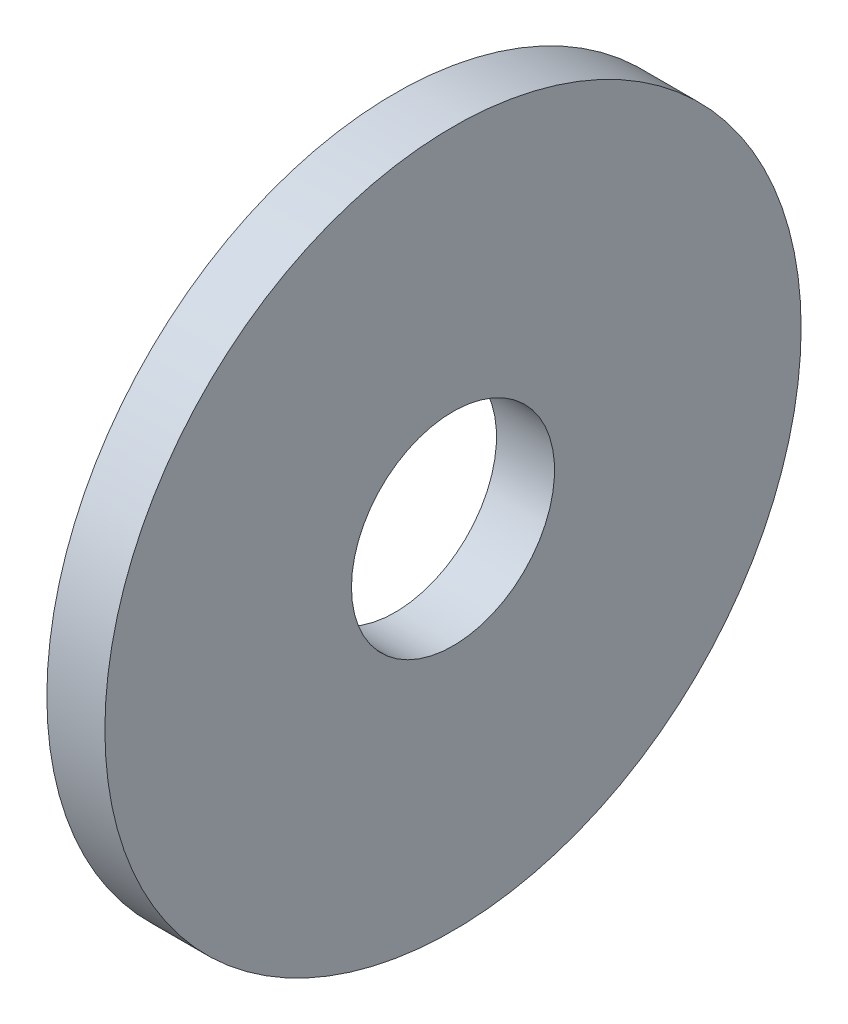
from build123d import *

# Parameters (mm, degrees)
ESQUISSE1_W = 3
ESQUISSE1_H = 12.75


with BuildPart() as part:
    # Esquisse1 → Base-R_volution (revolve)
    with BuildSketch(Plane(origin=(0, 0, 0), x_dir=(1, 0, 0), z_dir=(0, 1, 0)), mode=Mode.PRIVATE) as base_r_volution_sk:
        with Locations((1.5, 11.625)):
            Rectangle(ESQUISSE1_W, ESQUISSE1_H)
    revolve(base_r_volution_sk.sketch.rotate(Axis((0, 0, 0), (1, 0, 0)), 180), axis=Axis((0, 0, 0), (1, 0, 0)))


solid = part.part
